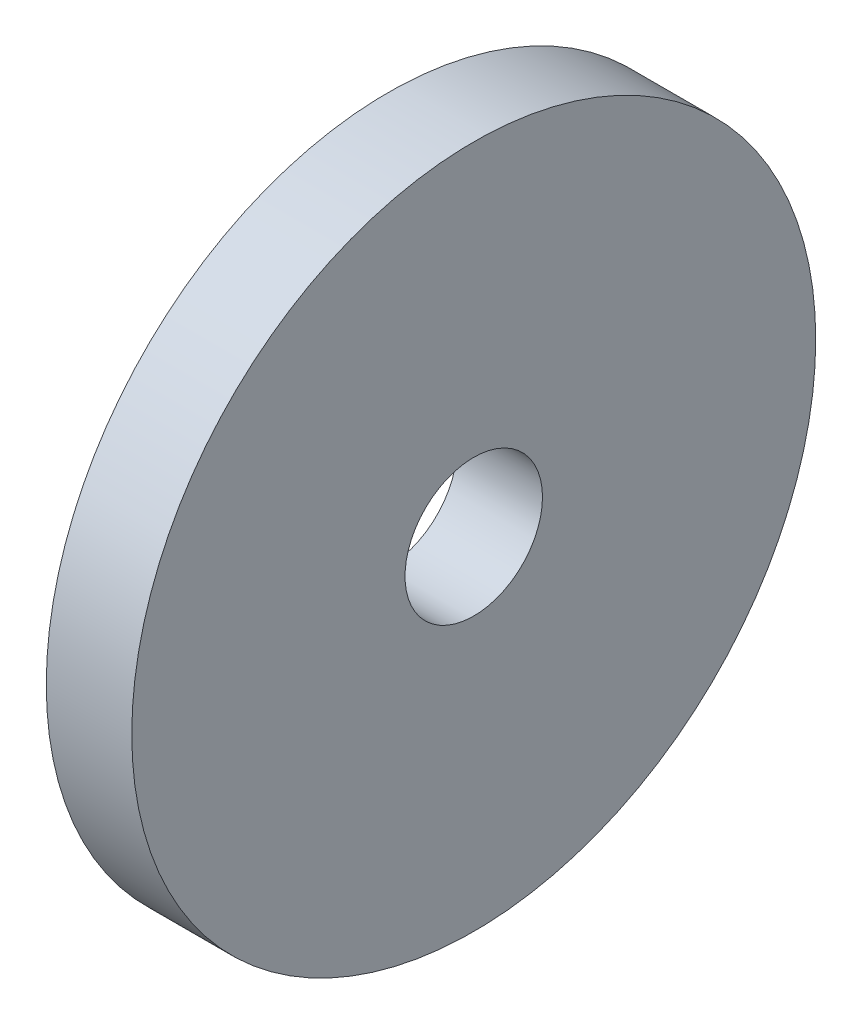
from build123d import *

# Parameters (mm, degrees)
SKETCH1_R               = 12.7
BOSS_EXTRUDE1_DEPTH     = 3.175
F_1_4_20_TAPPED_HOLE1_D = 5.1054


with BuildPart() as part:
    # Sketch1 → Boss-Extrude1 (new body)
    with BuildSketch(Plane(origin=(0, 0, 0), x_dir=(0, 0, -1), z_dir=(1, 0, 0))):
        Circle(SKETCH1_R)
    extrude(amount=BOSS_EXTRUDE1_DEPTH)

    # 1_4-20 Tapped Hole1 (through all)
    with Locations(Plane(origin=(3.175, 0, 0), x_dir=(0, 0, -1), z_dir=(1, 0, 0))):
        with Locations((0, 0)):
            Hole(F_1_4_20_TAPPED_HOLE1_D / 2)


solid = part.part
